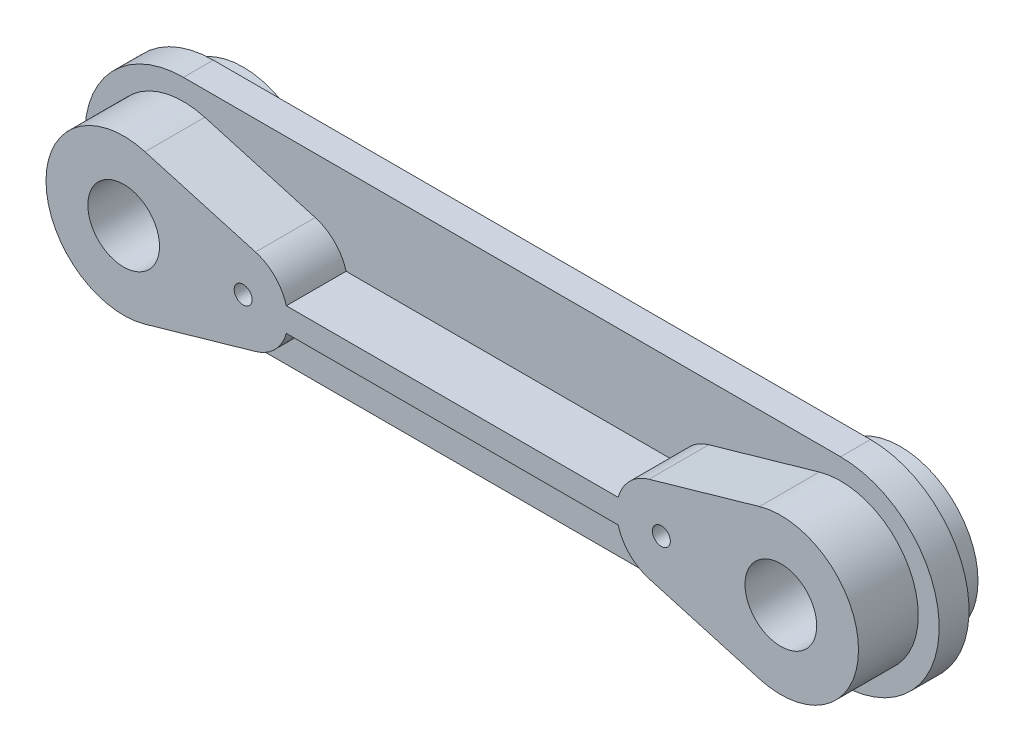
ISO-10303-21;
HEADER;
FILE_DESCRIPTION(('STEP AP214'),'2;1');
FILE_NAME('part.step','',(''),(''),'','','');
FILE_SCHEMA(('AUTOMOTIVE_DESIGN { 1 0 10303 214 1 1 1 1 }'));
ENDSEC;
DATA;
#1=APPLICATION_CONTEXT('core data for automotive mechanical design processes');
#2=APPLICATION_PROTOCOL_DEFINITION('international standard','automotive_design',2000,#1);
#3=PRODUCT_CONTEXT('',#1,'mechanical');
#4=PRODUCT('Part','Part','',(#3));
#5=PRODUCT_RELATED_PRODUCT_CATEGORY('part','',(#4));
#6=PRODUCT_DEFINITION_FORMATION('','',#4);
#7=PRODUCT_DEFINITION_CONTEXT('part definition',#1,'design');
#8=PRODUCT_DEFINITION('design','',#6,#7);
#9=PRODUCT_DEFINITION_SHAPE('','',#8);
#10=(LENGTH_UNIT() NAMED_UNIT(*) SI_UNIT(.MILLI.,.METRE.));
#11=(NAMED_UNIT(*) PLANE_ANGLE_UNIT() SI_UNIT($,.RADIAN.));
#12=(NAMED_UNIT(*) SI_UNIT($,.STERADIAN.) SOLID_ANGLE_UNIT());
#13=UNCERTAINTY_MEASURE_WITH_UNIT(LENGTH_MEASURE(1.E-05),#10,'distance_accuracy_value','');
#14=(GEOMETRIC_REPRESENTATION_CONTEXT(3) GLOBAL_UNCERTAINTY_ASSIGNED_CONTEXT((#13)) GLOBAL_UNIT_ASSIGNED_CONTEXT((#10,
#11,#12)) REPRESENTATION_CONTEXT('',''));
#15=CARTESIAN_POINT('',(0.,0.,0.));
#16=DIRECTION('',(0.,0.,1.));
#17=DIRECTION('',(1.,0.,0.));
#18=AXIS2_PLACEMENT_3D('',#15,#16,#17);
#19=CARTESIAN_POINT('',(0.,0.,0.));
#20=DIRECTION('',(0.,0.,1.));
#21=DIRECTION('',(1.,0.,0.));
#22=AXIS2_PLACEMENT_3D('',#19,#20,#21);
#23=PLANE('',#22);
#24=CARTESIAN_POINT('',(180.,0.,0.));
#25=DIRECTION('',(0.,0.,1.));
#26=DIRECTION('',(1.,0.,0.));
#27=AXIS2_PLACEMENT_3D('',#24,#25,#26);
#28=CIRCLE('',#27,2.99999999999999);
#29=CARTESIAN_POINT('',(183.,0.,0.));
#30=VERTEX_POINT('',#29);
#31=EDGE_CURVE('E507',#30,#30,#28,.T.);
#32=ORIENTED_EDGE('',*,*,#31,.T.);
#33=EDGE_LOOP('',(#32));
#34=FACE_BOUND('',#33,.T.);
#35=CARTESIAN_POINT('',(40.,0.,0.));
#36=DIRECTION('',(0.,0.,1.));
#37=DIRECTION('',(1.,0.,0.));
#38=AXIS2_PLACEMENT_3D('',#35,#36,#37);
#39=CIRCLE('',#38,3.);
#40=CARTESIAN_POINT('',(43.,0.,0.));
#41=VERTEX_POINT('',#40);
#42=EDGE_CURVE('E520',#41,#41,#39,.T.);
#43=ORIENTED_EDGE('',*,*,#42,.T.);
#44=EDGE_LOOP('',(#43));
#45=FACE_BOUND('',#44,.T.);
#46=CARTESIAN_POINT('',(220.,0.,0.));
#47=DIRECTION('',(0.,0.,1.));
#48=DIRECTION('',(1.,0.,0.));
#49=AXIS2_PLACEMENT_3D('',#46,#47,#48);
#50=CIRCLE('',#49,26.);
#51=CARTESIAN_POINT('',(246.,0.,0.));
#52=VERTEX_POINT('',#51);
#53=EDGE_CURVE('E47',#52,#52,#50,.F.);
#54=ORIENTED_EDGE('',*,*,#53,.F.);
#55=EDGE_LOOP('',(#54));
#56=FACE_BOUND('',#55,.T.);
#57=CARTESIAN_POINT('',(0.,0.,0.));
#58=DIRECTION('',(0.,0.,1.));
#59=DIRECTION('',(1.,0.,0.));
#60=AXIS2_PLACEMENT_3D('',#57,#58,#59);
#61=CIRCLE('',#60,33.);
#62=CARTESIAN_POINT('',(0.,33.,0.));
#63=VERTEX_POINT('',#62);
#64=CARTESIAN_POINT('',(0.,-33.,0.));
#65=VERTEX_POINT('',#64);
#66=EDGE_CURVE('E164',#63,#65,#61,.T.);
#67=ORIENTED_EDGE('',*,*,#66,.F.);
#68=DIRECTION('',(-1.,0.,0.));
#69=VECTOR('',#68,1.);
#70=CARTESIAN_POINT('',(0.,33.,0.));
#71=LINE('',#70,#69);
#72=CARTESIAN_POINT('',(220.,33.,0.));
#73=VERTEX_POINT('',#72);
#74=EDGE_CURVE('E259',#73,#63,#71,.T.);
#75=ORIENTED_EDGE('',*,*,#74,.F.);
#76=CARTESIAN_POINT('',(220.,0.,0.));
#77=DIRECTION('',(0.,0.,1.));
#78=DIRECTION('',(1.,0.,0.));
#79=AXIS2_PLACEMENT_3D('',#76,#77,#78);
#80=CIRCLE('',#79,33.);
#81=CARTESIAN_POINT('',(220.,-33.,0.));
#82=VERTEX_POINT('',#81);
#83=EDGE_CURVE('E257',#82,#73,#80,.T.);
#84=ORIENTED_EDGE('',*,*,#83,.F.);
#85=DIRECTION('',(1.,0.,0.));
#86=VECTOR('',#85,1.);
#87=CARTESIAN_POINT('',(0.,-33.,0.));
#88=LINE('',#87,#86);
#89=EDGE_CURVE('E255',#65,#82,#88,.T.);
#90=ORIENTED_EDGE('',*,*,#89,.F.);
#91=EDGE_LOOP('',(#67,#75,#84,#90));
#92=FACE_BOUND('',#91,.T.);
#93=CARTESIAN_POINT('',(0.,0.,0.));
#94=DIRECTION('',(0.,0.,1.));
#95=DIRECTION('',(1.,0.,0.));
#96=AXIS2_PLACEMENT_3D('',#93,#94,#95);
#97=CIRCLE('',#96,26.);
#98=CARTESIAN_POINT('',(26.,0.,0.));
#99=VERTEX_POINT('',#98);
#100=EDGE_CURVE('E11',#99,#99,#97,.F.);
#101=ORIENTED_EDGE('',*,*,#100,.F.);
#102=EDGE_LOOP('',(#101));
#103=FACE_BOUND('',#102,.T.);
#104=ADVANCED_FACE('F39',(#34,#45,#56,#92,#103),#23,.F.);
#105=CARTESIAN_POINT('',(0.,0.,10.));
#106=DIRECTION('',(0.,0.,1.));
#107=DIRECTION('',(1.,0.,0.));
#108=AXIS2_PLACEMENT_3D('',#105,#106,#107);
#109=PLANE('',#108);
#110=CARTESIAN_POINT('',(0.,0.,10.));
#111=DIRECTION('',(0.,0.,1.));
#112=DIRECTION('',(1.,0.,0.));
#113=AXIS2_PLACEMENT_3D('',#110,#111,#112);
#114=CIRCLE('',#113,33.);
#115=CARTESIAN_POINT('',(0.,33.,10.));
#116=VERTEX_POINT('',#115);
#117=CARTESIAN_POINT('',(0.,-33.,10.));
#118=VERTEX_POINT('',#117);
#119=EDGE_CURVE('E261',#116,#118,#114,.T.);
#120=ORIENTED_EDGE('',*,*,#119,.T.);
#121=DIRECTION('',(1.,0.,0.));
#122=VECTOR('',#121,1.);
#123=CARTESIAN_POINT('',(0.,-33.,10.));
#124=LINE('',#123,#122);
#125=CARTESIAN_POINT('',(220.,-33.,10.));
#126=VERTEX_POINT('',#125);
#127=EDGE_CURVE('E263',#118,#126,#124,.T.);
#128=ORIENTED_EDGE('',*,*,#127,.T.);
#129=CARTESIAN_POINT('',(220.,0.,10.));
#130=DIRECTION('',(0.,0.,1.));
#131=DIRECTION('',(1.,0.,0.));
#132=AXIS2_PLACEMENT_3D('',#129,#130,#131);
#133=CIRCLE('',#132,33.);
#134=CARTESIAN_POINT('',(220.,33.,10.));
#135=VERTEX_POINT('',#134);
#136=EDGE_CURVE('E265',#126,#135,#133,.T.);
#137=ORIENTED_EDGE('',*,*,#136,.T.);
#138=DIRECTION('',(-1.,0.,0.));
#139=VECTOR('',#138,1.);
#140=CARTESIAN_POINT('',(0.,33.,10.));
#141=LINE('',#140,#139);
#142=EDGE_CURVE('E62',#135,#116,#141,.T.);
#143=ORIENTED_EDGE('',*,*,#142,.T.);
#144=EDGE_LOOP('',(#120,#128,#137,#143));
#145=FACE_BOUND('',#144,.T.);
#146=DIRECTION('',(-0.961444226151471,0.275,0.));
#147=VECTOR('',#146,1.);
#148=CARTESIAN_POINT('',(44.125,14.4216633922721,10.));
#149=LINE('',#148,#147);
#150=CARTESIAN_POINT('',(44.125,14.4216633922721,10.));
#151=VERTEX_POINT('',#150);
#152=CARTESIAN_POINT('',(7.15,24.9975498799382,10.));
#153=VERTEX_POINT('',#152);
#154=EDGE_CURVE('E158',#151,#153,#149,.T.);
#155=ORIENTED_EDGE('',*,*,#154,.F.);
#156=CARTESIAN_POINT('',(40.,0.,10.));
#157=DIRECTION('',(0.,0.,1.));
#158=DIRECTION('',(1.,0.,0.));
#159=AXIS2_PLACEMENT_3D('',#156,#157,#158);
#160=CIRCLE('',#159,15.);
#161=CARTESIAN_POINT('',(54.456832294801,4.,10.));
#162=VERTEX_POINT('',#161);
#163=EDGE_CURVE('E169',#162,#151,#160,.T.);
#164=ORIENTED_EDGE('',*,*,#163,.F.);
#165=DIRECTION('',(-1.,0.,0.));
#166=VECTOR('',#165,1.);
#167=CARTESIAN_POINT('',(54.456832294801,4.,10.));
#168=LINE('',#167,#166);
#169=CARTESIAN_POINT('',(165.543167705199,4.,10.));
#170=VERTEX_POINT('',#169);
#171=EDGE_CURVE('E201',#170,#162,#168,.T.);
#172=ORIENTED_EDGE('',*,*,#171,.F.);
#173=CARTESIAN_POINT('',(180.,0.,10.));
#174=DIRECTION('',(0.,0.,1.));
#175=DIRECTION('',(1.,0.,0.));
#176=AXIS2_PLACEMENT_3D('',#173,#174,#175);
#177=CIRCLE('',#176,15.);
#178=CARTESIAN_POINT('',(175.875,14.4216633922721,10.));
#179=VERTEX_POINT('',#178);
#180=EDGE_CURVE('E199',#179,#170,#177,.T.);
#181=ORIENTED_EDGE('',*,*,#180,.F.);
#182=DIRECTION('',(-0.96144422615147,-0.275,0.));
#183=VECTOR('',#182,1.);
#184=CARTESIAN_POINT('',(175.875,14.4216633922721,10.));
#185=LINE('',#184,#183);
#186=CARTESIAN_POINT('',(212.85,24.9975498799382,10.));
#187=VERTEX_POINT('',#186);
#188=EDGE_CURVE('E197',#187,#179,#185,.T.);
#189=ORIENTED_EDGE('',*,*,#188,.F.);
#190=CARTESIAN_POINT('',(220.,0.,10.));
#191=DIRECTION('',(0.,0.,1.));
#192=DIRECTION('',(1.,0.,0.));
#193=AXIS2_PLACEMENT_3D('',#190,#191,#192);
#194=CIRCLE('',#193,26.);
#195=CARTESIAN_POINT('',(212.85,-24.9975498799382,10.));
#196=VERTEX_POINT('',#195);
#197=EDGE_CURVE('E195',#196,#187,#194,.T.);
#198=ORIENTED_EDGE('',*,*,#197,.F.);
#199=DIRECTION('',(0.961444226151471,-0.275,0.));
#200=VECTOR('',#199,1.);
#201=CARTESIAN_POINT('',(175.875,-14.4216633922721,10.));
#202=LINE('',#201,#200);
#203=CARTESIAN_POINT('',(175.875,-14.4216633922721,10.));
#204=VERTEX_POINT('',#203);
#205=EDGE_CURVE('E193',#204,#196,#202,.T.);
#206=ORIENTED_EDGE('',*,*,#205,.F.);
#207=CARTESIAN_POINT('',(180.,0.,10.));
#208=DIRECTION('',(0.,0.,1.));
#209=DIRECTION('',(1.,0.,0.));
#210=AXIS2_PLACEMENT_3D('',#207,#208,#209);
#211=CIRCLE('',#210,15.);
#212=CARTESIAN_POINT('',(165.543167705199,-4.,10.));
#213=VERTEX_POINT('',#212);
#214=EDGE_CURVE('E191',#213,#204,#211,.T.);
#215=ORIENTED_EDGE('',*,*,#214,.F.);
#216=DIRECTION('',(1.,0.,0.));
#217=VECTOR('',#216,1.);
#218=CARTESIAN_POINT('',(54.456832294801,-4.,10.));
#219=LINE('',#218,#217);
#220=CARTESIAN_POINT('',(54.456832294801,-4.,10.));
#221=VERTEX_POINT('',#220);
#222=EDGE_CURVE('E189',#221,#213,#219,.T.);
#223=ORIENTED_EDGE('',*,*,#222,.F.);
#224=CARTESIAN_POINT('',(40.,0.,10.));
#225=DIRECTION('',(0.,0.,1.));
#226=DIRECTION('',(1.,0.,0.));
#227=AXIS2_PLACEMENT_3D('',#224,#225,#226);
#228=CIRCLE('',#227,15.);
#229=CARTESIAN_POINT('',(44.125,-14.4216633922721,10.));
#230=VERTEX_POINT('',#229);
#231=EDGE_CURVE('E187',#230,#221,#228,.T.);
#232=ORIENTED_EDGE('',*,*,#231,.F.);
#233=DIRECTION('',(0.961444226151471,0.275,0.));
#234=VECTOR('',#233,1.);
#235=CARTESIAN_POINT('',(7.15,-24.9975498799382,10.));
#236=LINE('',#235,#234);
#237=CARTESIAN_POINT('',(7.15,-24.9975498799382,10.));
#238=VERTEX_POINT('',#237);
#239=EDGE_CURVE('E182',#238,#230,#236,.T.);
#240=ORIENTED_EDGE('',*,*,#239,.F.);
#241=CARTESIAN_POINT('',(0.,0.,10.));
#242=DIRECTION('',(0.,0.,1.));
#243=DIRECTION('',(1.,0.,0.));
#244=AXIS2_PLACEMENT_3D('',#241,#242,#243);
#245=CIRCLE('',#244,26.);
#246=EDGE_CURVE('E180',#153,#238,#245,.T.);
#247=ORIENTED_EDGE('',*,*,#246,.F.);
#248=EDGE_LOOP('',(#155,#164,#172,#181,#189,#198,#206,#215,#223,#232,#240,#247));
#249=FACE_BOUND('',#248,.T.);
#250=ADVANCED_FACE('F178',(#145,#249),#109,.T.);
#251=CARTESIAN_POINT('',(0.,0.,10.));
#252=DIRECTION('',(0.,0.,-1.));
#253=DIRECTION('',(-1.,0.,0.));
#254=AXIS2_PLACEMENT_3D('',#251,#252,#253);
#255=CYLINDRICAL_SURFACE('',#254,33.);
#256=ORIENTED_EDGE('',*,*,#66,.T.);
#257=DIRECTION('',(0.,0.,-1.));
#258=VECTOR('',#257,1.);
#259=CARTESIAN_POINT('',(0.,-33.,10.));
#260=LINE('',#259,#258);
#261=EDGE_CURVE('E277',#118,#65,#260,.T.);
#262=ORIENTED_EDGE('',*,*,#261,.F.);
#263=ORIENTED_EDGE('',*,*,#119,.F.);
#264=DIRECTION('',(0.,0.,-1.));
#265=VECTOR('',#264,1.);
#266=CARTESIAN_POINT('',(0.,33.,10.));
#267=LINE('',#266,#265);
#268=EDGE_CURVE('E268',#116,#63,#267,.T.);
#269=ORIENTED_EDGE('',*,*,#268,.T.);
#270=EDGE_LOOP('',(#256,#262,#263,#269));
#271=FACE_BOUND('',#270,.T.);
#272=ADVANCED_FACE('F41',(#271),#255,.T.);
#273=CARTESIAN_POINT('',(0.,-33.,10.));
#274=DIRECTION('',(0.,1.,0.));
#275=DIRECTION('',(-1.,0.,0.));
#276=AXIS2_PLACEMENT_3D('',#273,#274,#275);
#277=PLANE('',#276);
#278=ORIENTED_EDGE('',*,*,#89,.T.);
#279=DIRECTION('',(0.,0.,-1.));
#280=VECTOR('',#279,1.);
#281=CARTESIAN_POINT('',(220.,-33.,10.));
#282=LINE('',#281,#280);
#283=EDGE_CURVE('E274',#126,#82,#282,.T.);
#284=ORIENTED_EDGE('',*,*,#283,.F.);
#285=ORIENTED_EDGE('',*,*,#127,.F.);
#286=ORIENTED_EDGE('',*,*,#261,.T.);
#287=EDGE_LOOP('',(#278,#284,#285,#286));
#288=FACE_BOUND('',#287,.T.);
#289=ADVANCED_FACE('F369',(#288),#277,.F.);
#290=CARTESIAN_POINT('',(220.,0.,10.));
#291=DIRECTION('',(0.,0.,-1.));
#292=DIRECTION('',(-1.,0.,0.));
#293=AXIS2_PLACEMENT_3D('',#290,#291,#292);
#294=CYLINDRICAL_SURFACE('',#293,33.);
#295=ORIENTED_EDGE('',*,*,#83,.T.);
#296=DIRECTION('',(0.,0.,-1.));
#297=VECTOR('',#296,1.);
#298=CARTESIAN_POINT('',(220.,33.,10.));
#299=LINE('',#298,#297);
#300=EDGE_CURVE('E271',#135,#73,#299,.T.);
#301=ORIENTED_EDGE('',*,*,#300,.F.);
#302=ORIENTED_EDGE('',*,*,#136,.F.);
#303=ORIENTED_EDGE('',*,*,#283,.T.);
#304=EDGE_LOOP('',(#295,#301,#302,#303));
#305=FACE_BOUND('',#304,.T.);
#306=ADVANCED_FACE('F366',(#305),#294,.T.);
#307=CARTESIAN_POINT('',(0.,33.,10.));
#308=DIRECTION('',(0.,-1.,0.));
#309=DIRECTION('',(1.,0.,0.));
#310=AXIS2_PLACEMENT_3D('',#307,#308,#309);
#311=PLANE('',#310);
#312=ORIENTED_EDGE('',*,*,#74,.T.);
#313=ORIENTED_EDGE('',*,*,#268,.F.);
#314=ORIENTED_EDGE('',*,*,#142,.F.);
#315=ORIENTED_EDGE('',*,*,#300,.T.);
#316=EDGE_LOOP('',(#312,#313,#314,#315));
#317=FACE_BOUND('',#316,.T.);
#318=ADVANCED_FACE('F360',(#317),#311,.F.);
#319=CARTESIAN_POINT('',(40.,0.,30.));
#320=DIRECTION('',(0.,0.,-1.));
#321=DIRECTION('',(-1.,0.,0.));
#322=AXIS2_PLACEMENT_3D('',#319,#320,#321);
#323=CYLINDRICAL_SURFACE('',#322,15.);
#324=ORIENTED_EDGE('',*,*,#163,.T.);
#325=DIRECTION('',(0.,0.,-1.));
#326=VECTOR('',#325,1.);
#327=CARTESIAN_POINT('',(44.125,14.4216633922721,30.));
#328=LINE('',#327,#326);
#329=CARTESIAN_POINT('',(44.125,14.4216633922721,30.));
#330=VERTEX_POINT('',#329);
#331=EDGE_CURVE('E153',#330,#151,#328,.T.);
#332=ORIENTED_EDGE('',*,*,#331,.F.);
#333=CARTESIAN_POINT('',(40.,0.,30.));
#334=DIRECTION('',(0.,0.,1.));
#335=DIRECTION('',(1.,0.,0.));
#336=AXIS2_PLACEMENT_3D('',#333,#334,#335);
#337=CIRCLE('',#336,15.);
#338=CARTESIAN_POINT('',(54.456832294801,4.,30.));
#339=VERTEX_POINT('',#338);
#340=EDGE_CURVE('E203',#339,#330,#337,.T.);
#341=ORIENTED_EDGE('',*,*,#340,.F.);
#342=DIRECTION('',(0.,0.,-1.));
#343=VECTOR('',#342,1.);
#344=CARTESIAN_POINT('',(54.456832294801,4.,30.));
#345=LINE('',#344,#343);
#346=EDGE_CURVE('E172',#339,#162,#345,.T.);
#347=ORIENTED_EDGE('',*,*,#346,.T.);
#348=EDGE_LOOP('',(#324,#332,#341,#347));
#349=FACE_BOUND('',#348,.T.);
#350=ADVANCED_FACE('F170',(#349),#323,.T.);
#351=CARTESIAN_POINT('',(44.125,14.4216633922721,30.));
#352=DIRECTION('',(-0.275,-0.961444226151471,0.));
#353=DIRECTION('',(0.961444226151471,-0.275,0.));
#354=AXIS2_PLACEMENT_3D('',#351,#352,#353);
#355=PLANE('',#354);
#356=ORIENTED_EDGE('',*,*,#154,.T.);
#357=DIRECTION('',(0.,0.,-1.));
#358=VECTOR('',#357,1.);
#359=CARTESIAN_POINT('',(7.15,24.9975498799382,30.));
#360=LINE('',#359,#358);
#361=CARTESIAN_POINT('',(7.15,24.9975498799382,30.));
#362=VERTEX_POINT('',#361);
#363=EDGE_CURVE('E165',#362,#153,#360,.T.);
#364=ORIENTED_EDGE('',*,*,#363,.F.);
#365=DIRECTION('',(-0.961444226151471,0.275,0.));
#366=VECTOR('',#365,1.);
#367=CARTESIAN_POINT('',(44.125,14.4216633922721,30.));
#368=LINE('',#367,#366);
#369=EDGE_CURVE('E160',#330,#362,#368,.T.);
#370=ORIENTED_EDGE('',*,*,#369,.F.);
#371=ORIENTED_EDGE('',*,*,#331,.T.);
#372=EDGE_LOOP('',(#356,#364,#370,#371));
#373=FACE_BOUND('',#372,.T.);
#374=ADVANCED_FACE('F155',(#373),#355,.F.);
#375=CARTESIAN_POINT('',(0.,0.,30.));
#376=DIRECTION('',(0.,0.,-1.));
#377=DIRECTION('',(-1.,0.,0.));
#378=AXIS2_PLACEMENT_3D('',#375,#376,#377);
#379=CYLINDRICAL_SURFACE('',#378,26.);
#380=ORIENTED_EDGE('',*,*,#246,.T.);
#381=DIRECTION('',(0.,0.,-1.));
#382=VECTOR('',#381,1.);
#383=CARTESIAN_POINT('',(7.15,-24.9975498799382,30.));
#384=LINE('',#383,#382);
#385=CARTESIAN_POINT('',(7.15,-24.9975498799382,30.));
#386=VERTEX_POINT('',#385);
#387=EDGE_CURVE('E249',#386,#238,#384,.T.);
#388=ORIENTED_EDGE('',*,*,#387,.F.);
#389=CARTESIAN_POINT('',(0.,0.,30.));
#390=DIRECTION('',(0.,0.,1.));
#391=DIRECTION('',(1.,0.,0.));
#392=AXIS2_PLACEMENT_3D('',#389,#390,#391);
#393=CIRCLE('',#392,26.);
#394=EDGE_CURVE('E206',#362,#386,#393,.T.);
#395=ORIENTED_EDGE('',*,*,#394,.F.);
#396=ORIENTED_EDGE('',*,*,#363,.T.);
#397=EDGE_LOOP('',(#380,#388,#395,#396));
#398=FACE_BOUND('',#397,.T.);
#399=ADVANCED_FACE('F352',(#398),#379,.T.);
#400=CARTESIAN_POINT('',(7.15,-24.9975498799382,30.));
#401=DIRECTION('',(-0.275,0.961444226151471,0.));
#402=DIRECTION('',(-0.961444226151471,-0.275,0.));
#403=AXIS2_PLACEMENT_3D('',#400,#401,#402);
#404=PLANE('',#403);
#405=ORIENTED_EDGE('',*,*,#239,.T.);
#406=DIRECTION('',(0.,0.,-1.));
#407=VECTOR('',#406,1.);
#408=CARTESIAN_POINT('',(44.125,-14.4216633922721,30.));
#409=LINE('',#408,#407);
#410=CARTESIAN_POINT('',(44.125,-14.4216633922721,30.));
#411=VERTEX_POINT('',#410);
#412=EDGE_CURVE('E246',#411,#230,#409,.T.);
#413=ORIENTED_EDGE('',*,*,#412,.F.);
#414=DIRECTION('',(0.961444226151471,0.275,0.));
#415=VECTOR('',#414,1.);
#416=CARTESIAN_POINT('',(7.15,-24.9975498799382,30.));
#417=LINE('',#416,#415);
#418=EDGE_CURVE('E208',#386,#411,#417,.T.);
#419=ORIENTED_EDGE('',*,*,#418,.F.);
#420=ORIENTED_EDGE('',*,*,#387,.T.);
#421=EDGE_LOOP('',(#405,#413,#419,#420));
#422=FACE_BOUND('',#421,.T.);
#423=ADVANCED_FACE('F348',(#422),#404,.F.);
#424=CARTESIAN_POINT('',(40.,0.,30.));
#425=DIRECTION('',(0.,0.,-1.));
#426=DIRECTION('',(-1.,0.,0.));
#427=AXIS2_PLACEMENT_3D('',#424,#425,#426);
#428=CYLINDRICAL_SURFACE('',#427,15.);
#429=ORIENTED_EDGE('',*,*,#231,.T.);
#430=DIRECTION('',(0.,0.,-1.));
#431=VECTOR('',#430,1.);
#432=CARTESIAN_POINT('',(54.456832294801,-4.,30.));
#433=LINE('',#432,#431);
#434=CARTESIAN_POINT('',(54.456832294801,-4.,30.));
#435=VERTEX_POINT('',#434);
#436=EDGE_CURVE('E243',#435,#221,#433,.T.);
#437=ORIENTED_EDGE('',*,*,#436,.F.);
#438=CARTESIAN_POINT('',(40.,0.,30.));
#439=DIRECTION('',(0.,0.,1.));
#440=DIRECTION('',(1.,0.,0.));
#441=AXIS2_PLACEMENT_3D('',#438,#439,#440);
#442=CIRCLE('',#441,15.);
#443=EDGE_CURVE('E210',#411,#435,#442,.T.);
#444=ORIENTED_EDGE('',*,*,#443,.F.);
#445=ORIENTED_EDGE('',*,*,#412,.T.);
#446=EDGE_LOOP('',(#429,#437,#444,#445));
#447=FACE_BOUND('',#446,.T.);
#448=ADVANCED_FACE('F344',(#447),#428,.T.);
#449=CARTESIAN_POINT('',(54.456832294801,-4.,30.));
#450=DIRECTION('',(0.,1.,0.));
#451=DIRECTION('',(0.,0.,1.));
#452=AXIS2_PLACEMENT_3D('',#449,#450,#451);
#453=PLANE('',#452);
#454=ORIENTED_EDGE('',*,*,#222,.T.);
#455=DIRECTION('',(0.,0.,-1.));
#456=VECTOR('',#455,1.);
#457=CARTESIAN_POINT('',(165.543167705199,-4.,30.));
#458=LINE('',#457,#456);
#459=CARTESIAN_POINT('',(165.543167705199,-4.,30.));
#460=VERTEX_POINT('',#459);
#461=EDGE_CURVE('E240',#460,#213,#458,.T.);
#462=ORIENTED_EDGE('',*,*,#461,.F.);
#463=DIRECTION('',(1.,0.,0.));
#464=VECTOR('',#463,1.);
#465=CARTESIAN_POINT('',(54.456832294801,-4.,30.));
#466=LINE('',#465,#464);
#467=EDGE_CURVE('E212',#435,#460,#466,.T.);
#468=ORIENTED_EDGE('',*,*,#467,.F.);
#469=ORIENTED_EDGE('',*,*,#436,.T.);
#470=EDGE_LOOP('',(#454,#462,#468,#469));
#471=FACE_BOUND('',#470,.T.);
#472=ADVANCED_FACE('F340',(#471),#453,.F.);
#473=CARTESIAN_POINT('',(180.,0.,30.));
#474=DIRECTION('',(0.,0.,-1.));
#475=DIRECTION('',(-1.,0.,0.));
#476=AXIS2_PLACEMENT_3D('',#473,#474,#475);
#477=CYLINDRICAL_SURFACE('',#476,15.);
#478=ORIENTED_EDGE('',*,*,#214,.T.);
#479=DIRECTION('',(0.,0.,-1.));
#480=VECTOR('',#479,1.);
#481=CARTESIAN_POINT('',(175.875,-14.4216633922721,30.));
#482=LINE('',#481,#480);
#483=CARTESIAN_POINT('',(175.875,-14.4216633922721,30.));
#484=VERTEX_POINT('',#483);
#485=EDGE_CURVE('E237',#484,#204,#482,.T.);
#486=ORIENTED_EDGE('',*,*,#485,.F.);
#487=CARTESIAN_POINT('',(180.,0.,30.));
#488=DIRECTION('',(0.,0.,1.));
#489=DIRECTION('',(1.,0.,0.));
#490=AXIS2_PLACEMENT_3D('',#487,#488,#489);
#491=CIRCLE('',#490,15.);
#492=EDGE_CURVE('E214',#460,#484,#491,.T.);
#493=ORIENTED_EDGE('',*,*,#492,.F.);
#494=ORIENTED_EDGE('',*,*,#461,.T.);
#495=EDGE_LOOP('',(#478,#486,#493,#494));
#496=FACE_BOUND('',#495,.T.);
#497=ADVANCED_FACE('F336',(#496),#477,.T.);
#498=CARTESIAN_POINT('',(175.875,-14.4216633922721,30.));
#499=DIRECTION('',(0.275,0.961444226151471,0.));
#500=DIRECTION('',(-0.961444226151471,0.275,0.));
#501=AXIS2_PLACEMENT_3D('',#498,#499,#500);
#502=PLANE('',#501);
#503=ORIENTED_EDGE('',*,*,#205,.T.);
#504=DIRECTION('',(0.,0.,-1.));
#505=VECTOR('',#504,1.);
#506=CARTESIAN_POINT('',(212.85,-24.9975498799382,30.));
#507=LINE('',#506,#505);
#508=CARTESIAN_POINT('',(212.85,-24.9975498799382,30.));
#509=VERTEX_POINT('',#508);
#510=EDGE_CURVE('E234',#509,#196,#507,.T.);
#511=ORIENTED_EDGE('',*,*,#510,.F.);
#512=DIRECTION('',(0.961444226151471,-0.275,0.));
#513=VECTOR('',#512,1.);
#514=CARTESIAN_POINT('',(175.875,-14.4216633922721,30.));
#515=LINE('',#514,#513);
#516=EDGE_CURVE('E216',#484,#509,#515,.T.);
#517=ORIENTED_EDGE('',*,*,#516,.F.);
#518=ORIENTED_EDGE('',*,*,#485,.T.);
#519=EDGE_LOOP('',(#503,#511,#517,#518));
#520=FACE_BOUND('',#519,.T.);
#521=ADVANCED_FACE('F332',(#520),#502,.F.);
#522=CARTESIAN_POINT('',(220.,0.,30.));
#523=DIRECTION('',(0.,0.,-1.));
#524=DIRECTION('',(-1.,0.,0.));
#525=AXIS2_PLACEMENT_3D('',#522,#523,#524);
#526=CYLINDRICAL_SURFACE('',#525,26.);
#527=ORIENTED_EDGE('',*,*,#197,.T.);
#528=DIRECTION('',(0.,0.,-1.));
#529=VECTOR('',#528,1.);
#530=CARTESIAN_POINT('',(212.85,24.9975498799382,30.));
#531=LINE('',#530,#529);
#532=CARTESIAN_POINT('',(212.85,24.9975498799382,30.));
#533=VERTEX_POINT('',#532);
#534=EDGE_CURVE('E231',#533,#187,#531,.T.);
#535=ORIENTED_EDGE('',*,*,#534,.F.);
#536=CARTESIAN_POINT('',(220.,0.,30.));
#537=DIRECTION('',(0.,0.,1.));
#538=DIRECTION('',(1.,0.,0.));
#539=AXIS2_PLACEMENT_3D('',#536,#537,#538);
#540=CIRCLE('',#539,26.);
#541=EDGE_CURVE('E218',#509,#533,#540,.T.);
#542=ORIENTED_EDGE('',*,*,#541,.F.);
#543=ORIENTED_EDGE('',*,*,#510,.T.);
#544=EDGE_LOOP('',(#527,#535,#542,#543));
#545=FACE_BOUND('',#544,.T.);
#546=ADVANCED_FACE('F328',(#545),#526,.T.);
#547=CARTESIAN_POINT('',(175.875,14.4216633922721,30.));
#548=DIRECTION('',(0.275,-0.961444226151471,0.));
#549=DIRECTION('',(0.961444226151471,0.275,0.));
#550=AXIS2_PLACEMENT_3D('',#547,#548,#549);
#551=PLANE('',#550);
#552=ORIENTED_EDGE('',*,*,#188,.T.);
#553=DIRECTION('',(0.,0.,-1.));
#554=VECTOR('',#553,1.);
#555=CARTESIAN_POINT('',(175.875,14.4216633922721,30.));
#556=LINE('',#555,#554);
#557=CARTESIAN_POINT('',(175.875,14.4216633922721,30.));
#558=VERTEX_POINT('',#557);
#559=EDGE_CURVE('E228',#558,#179,#556,.T.);
#560=ORIENTED_EDGE('',*,*,#559,.F.);
#561=DIRECTION('',(-0.96144422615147,-0.275,0.));
#562=VECTOR('',#561,1.);
#563=CARTESIAN_POINT('',(175.875,14.4216633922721,30.));
#564=LINE('',#563,#562);
#565=EDGE_CURVE('E220',#533,#558,#564,.T.);
#566=ORIENTED_EDGE('',*,*,#565,.F.);
#567=ORIENTED_EDGE('',*,*,#534,.T.);
#568=EDGE_LOOP('',(#552,#560,#566,#567));
#569=FACE_BOUND('',#568,.T.);
#570=ADVANCED_FACE('F324',(#569),#551,.F.);
#571=CARTESIAN_POINT('',(180.,0.,30.));
#572=DIRECTION('',(0.,0.,-1.));
#573=DIRECTION('',(-1.,0.,0.));
#574=AXIS2_PLACEMENT_3D('',#571,#572,#573);
#575=CYLINDRICAL_SURFACE('',#574,15.);
#576=ORIENTED_EDGE('',*,*,#180,.T.);
#577=DIRECTION('',(0.,0.,-1.));
#578=VECTOR('',#577,1.);
#579=CARTESIAN_POINT('',(165.543167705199,4.,30.));
#580=LINE('',#579,#578);
#581=CARTESIAN_POINT('',(165.543167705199,4.,30.));
#582=VERTEX_POINT('',#581);
#583=EDGE_CURVE('E54',#582,#170,#580,.T.);
#584=ORIENTED_EDGE('',*,*,#583,.F.);
#585=CARTESIAN_POINT('',(180.,0.,30.));
#586=DIRECTION('',(0.,0.,1.));
#587=DIRECTION('',(1.,0.,0.));
#588=AXIS2_PLACEMENT_3D('',#585,#586,#587);
#589=CIRCLE('',#588,15.);
#590=EDGE_CURVE('E222',#558,#582,#589,.T.);
#591=ORIENTED_EDGE('',*,*,#590,.F.);
#592=ORIENTED_EDGE('',*,*,#559,.T.);
#593=EDGE_LOOP('',(#576,#584,#591,#592));
#594=FACE_BOUND('',#593,.T.);
#595=ADVANCED_FACE('F321',(#594),#575,.T.);
#596=CARTESIAN_POINT('',(54.456832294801,4.,30.));
#597=DIRECTION('',(0.,-1.,0.));
#598=DIRECTION('',(0.,0.,-1.));
#599=AXIS2_PLACEMENT_3D('',#596,#597,#598);
#600=PLANE('',#599);
#601=ORIENTED_EDGE('',*,*,#171,.T.);
#602=ORIENTED_EDGE('',*,*,#346,.F.);
#603=DIRECTION('',(-1.,0.,0.));
#604=VECTOR('',#603,1.);
#605=CARTESIAN_POINT('',(54.456832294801,4.,30.));
#606=LINE('',#605,#604);
#607=EDGE_CURVE('E224',#582,#339,#606,.T.);
#608=ORIENTED_EDGE('',*,*,#607,.F.);
#609=ORIENTED_EDGE('',*,*,#583,.T.);
#610=EDGE_LOOP('',(#601,#602,#608,#609));
#611=FACE_BOUND('',#610,.T.);
#612=ADVANCED_FACE('F317',(#611),#600,.F.);
#613=CARTESIAN_POINT('',(40.,0.,30.));
#614=DIRECTION('',(0.,0.,1.));
#615=DIRECTION('',(1.,0.,0.));
#616=AXIS2_PLACEMENT_3D('',#613,#614,#615);
#617=PLANE('',#616);
#618=CARTESIAN_POINT('',(180.,0.,30.));
#619=DIRECTION('',(0.,0.,1.));
#620=DIRECTION('',(1.,0.,0.));
#621=AXIS2_PLACEMENT_3D('',#618,#619,#620);
#622=CIRCLE('',#621,2.99999999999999);
#623=CARTESIAN_POINT('',(183.,0.,30.));
#624=VERTEX_POINT('',#623);
#625=EDGE_CURVE('E504',#624,#624,#622,.T.);
#626=ORIENTED_EDGE('',*,*,#625,.F.);
#627=EDGE_LOOP('',(#626));
#628=FACE_BOUND('',#627,.T.);
#629=CARTESIAN_POINT('',(220.,0.,30.));
#630=DIRECTION('',(0.,0.,1.));
#631=DIRECTION('',(1.,0.,0.));
#632=AXIS2_PLACEMENT_3D('',#629,#630,#631);
#633=CIRCLE('',#632,12.);
#634=CARTESIAN_POINT('',(232.,0.,30.));
#635=VERTEX_POINT('',#634);
#636=EDGE_CURVE('E508',#635,#635,#633,.T.);
#637=ORIENTED_EDGE('',*,*,#636,.F.);
#638=EDGE_LOOP('',(#637));
#639=FACE_BOUND('',#638,.T.);
#640=CARTESIAN_POINT('',(40.,0.,30.));
#641=DIRECTION('',(0.,0.,1.));
#642=DIRECTION('',(1.,0.,0.));
#643=AXIS2_PLACEMENT_3D('',#640,#641,#642);
#644=CIRCLE('',#643,3.);
#645=CARTESIAN_POINT('',(43.,0.,30.));
#646=VERTEX_POINT('',#645);
#647=EDGE_CURVE('E517',#646,#646,#644,.T.);
#648=ORIENTED_EDGE('',*,*,#647,.F.);
#649=EDGE_LOOP('',(#648));
#650=FACE_BOUND('',#649,.T.);
#651=CARTESIAN_POINT('',(0.,0.,30.));
#652=DIRECTION('',(0.,0.,1.));
#653=DIRECTION('',(1.,0.,0.));
#654=AXIS2_PLACEMENT_3D('',#651,#652,#653);
#655=CIRCLE('',#654,12.);
#656=CARTESIAN_POINT('',(12.,0.,30.));
#657=VERTEX_POINT('',#656);
#658=EDGE_CURVE('E523',#657,#657,#655,.T.);
#659=ORIENTED_EDGE('',*,*,#658,.F.);
#660=EDGE_LOOP('',(#659));
#661=FACE_BOUND('',#660,.T.);
#662=ORIENTED_EDGE('',*,*,#340,.T.);
#663=ORIENTED_EDGE('',*,*,#369,.T.);
#664=ORIENTED_EDGE('',*,*,#394,.T.);
#665=ORIENTED_EDGE('',*,*,#418,.T.);
#666=ORIENTED_EDGE('',*,*,#443,.T.);
#667=ORIENTED_EDGE('',*,*,#467,.T.);
#668=ORIENTED_EDGE('',*,*,#492,.T.);
#669=ORIENTED_EDGE('',*,*,#516,.T.);
#670=ORIENTED_EDGE('',*,*,#541,.T.);
#671=ORIENTED_EDGE('',*,*,#565,.T.);
#672=ORIENTED_EDGE('',*,*,#590,.T.);
#673=ORIENTED_EDGE('',*,*,#607,.T.);
#674=EDGE_LOOP('',(#662,#663,#664,#665,#666,#667,#668,#669,#670,#671,#672,#673));
#675=FACE_BOUND('',#674,.T.);
#676=ADVANCED_FACE('F313',(#628,#639,#650,#661,#675),#617,.T.);
#677=CARTESIAN_POINT('',(220.,0.,-10.));
#678=DIRECTION('',(0.,0.,1.));
#679=DIRECTION('',(1.,0.,0.));
#680=AXIS2_PLACEMENT_3D('',#677,#678,#679);
#681=CYLINDRICAL_SURFACE('',#680,26.);
#682=CARTESIAN_POINT('',(220.,0.,-10.));
#683=DIRECTION('',(0.,0.,-1.));
#684=DIRECTION('',(-1.,0.,0.));
#685=AXIS2_PLACEMENT_3D('',#682,#683,#684);
#686=CIRCLE('',#685,26.);
#687=CARTESIAN_POINT('',(194.,0.,-10.));
#688=VERTEX_POINT('',#687);
#689=EDGE_CURVE('E175',#688,#688,#686,.T.);
#690=ORIENTED_EDGE('',*,*,#689,.F.);
#691=EDGE_LOOP('',(#690));
#692=FACE_BOUND('',#691,.T.);
#693=ORIENTED_EDGE('',*,*,#53,.T.);
#694=EDGE_LOOP('',(#693));
#695=FACE_BOUND('',#694,.T.);
#696=ADVANCED_FACE('F282',(#692,#695),#681,.T.);
#697=CARTESIAN_POINT('',(220.,0.,-10.));
#698=DIRECTION('',(0.,0.,-1.));
#699=DIRECTION('',(-1.,0.,0.));
#700=AXIS2_PLACEMENT_3D('',#697,#698,#699);
#701=PLANE('',#700);
#702=CARTESIAN_POINT('',(220.,0.,-10.));
#703=DIRECTION('',(0.,0.,1.));
#704=DIRECTION('',(1.,0.,0.));
#705=AXIS2_PLACEMENT_3D('',#702,#703,#704);
#706=CIRCLE('',#705,12.);
#707=CARTESIAN_POINT('',(232.,0.,-10.));
#708=VERTEX_POINT('',#707);
#709=EDGE_CURVE('E511',#708,#708,#706,.T.);
#710=ORIENTED_EDGE('',*,*,#709,.T.);
#711=EDGE_LOOP('',(#710));
#712=FACE_BOUND('',#711,.T.);
#713=ORIENTED_EDGE('',*,*,#689,.T.);
#714=EDGE_LOOP('',(#713));
#715=FACE_BOUND('',#714,.T.);
#716=ADVANCED_FACE('F296',(#712,#715),#701,.T.);
#717=CARTESIAN_POINT('',(0.,0.,-10.));
#718=DIRECTION('',(0.,0.,1.));
#719=DIRECTION('',(1.,0.,0.));
#720=AXIS2_PLACEMENT_3D('',#717,#718,#719);
#721=CYLINDRICAL_SURFACE('',#720,26.);
#722=CARTESIAN_POINT('',(0.,0.,-10.));
#723=DIRECTION('',(0.,0.,-1.));
#724=DIRECTION('',(-1.,0.,0.));
#725=AXIS2_PLACEMENT_3D('',#722,#723,#724);
#726=CIRCLE('',#725,26.);
#727=CARTESIAN_POINT('',(-26.,0.,-10.));
#728=VERTEX_POINT('',#727);
#729=EDGE_CURVE('E529',#728,#728,#726,.T.);
#730=ORIENTED_EDGE('',*,*,#729,.F.);
#731=EDGE_LOOP('',(#730));
#732=FACE_BOUND('',#731,.T.);
#733=ORIENTED_EDGE('',*,*,#100,.T.);
#734=EDGE_LOOP('',(#733));
#735=FACE_BOUND('',#734,.T.);
#736=ADVANCED_FACE('F293',(#732,#735),#721,.T.);
#737=CARTESIAN_POINT('',(0.,0.,-10.));
#738=DIRECTION('',(0.,0.,-1.));
#739=DIRECTION('',(-1.,0.,0.));
#740=AXIS2_PLACEMENT_3D('',#737,#738,#739);
#741=PLANE('',#740);
#742=CARTESIAN_POINT('',(0.,0.,-10.));
#743=DIRECTION('',(0.,0.,1.));
#744=DIRECTION('',(1.,0.,0.));
#745=AXIS2_PLACEMENT_3D('',#742,#743,#744);
#746=CIRCLE('',#745,12.);
#747=CARTESIAN_POINT('',(12.,0.,-10.));
#748=VERTEX_POINT('',#747);
#749=EDGE_CURVE('E526',#748,#748,#746,.T.);
#750=ORIENTED_EDGE('',*,*,#749,.T.);
#751=EDGE_LOOP('',(#750));
#752=FACE_BOUND('',#751,.T.);
#753=ORIENTED_EDGE('',*,*,#729,.T.);
#754=EDGE_LOOP('',(#753));
#755=FACE_BOUND('',#754,.T.);
#756=ADVANCED_FACE('F295',(#752,#755),#741,.T.);
#757=CARTESIAN_POINT('',(0.,0.,-10.));
#758=DIRECTION('',(0.,0.,1.));
#759=DIRECTION('',(1.,0.,0.));
#760=AXIS2_PLACEMENT_3D('',#757,#758,#759);
#761=CYLINDRICAL_SURFACE('',#760,12.);
#762=ORIENTED_EDGE('',*,*,#749,.F.);
#763=EDGE_LOOP('',(#762));
#764=FACE_BOUND('',#763,.T.);
#765=ORIENTED_EDGE('',*,*,#658,.T.);
#766=EDGE_LOOP('',(#765));
#767=FACE_BOUND('',#766,.T.);
#768=ADVANCED_FACE('F303',(#764,#767),#761,.F.);
#769=CARTESIAN_POINT('',(40.,0.,-10.));
#770=DIRECTION('',(0.,0.,1.));
#771=DIRECTION('',(1.,0.,0.));
#772=AXIS2_PLACEMENT_3D('',#769,#770,#771);
#773=CYLINDRICAL_SURFACE('',#772,3.);
#774=ORIENTED_EDGE('',*,*,#647,.T.);
#775=EDGE_LOOP('',(#774));
#776=FACE_BOUND('',#775,.T.);
#777=ORIENTED_EDGE('',*,*,#42,.F.);
#778=EDGE_LOOP('',(#777));
#779=FACE_BOUND('',#778,.T.);
#780=ADVANCED_FACE('F476',(#776,#779),#773,.F.);
#781=CARTESIAN_POINT('',(220.,0.,-10.));
#782=DIRECTION('',(0.,0.,1.));
#783=DIRECTION('',(1.,0.,0.));
#784=AXIS2_PLACEMENT_3D('',#781,#782,#783);
#785=CYLINDRICAL_SURFACE('',#784,12.);
#786=ORIENTED_EDGE('',*,*,#709,.F.);
#787=EDGE_LOOP('',(#786));
#788=FACE_BOUND('',#787,.T.);
#789=ORIENTED_EDGE('',*,*,#636,.T.);
#790=EDGE_LOOP('',(#789));
#791=FACE_BOUND('',#790,.T.);
#792=ADVANCED_FACE('F483',(#788,#791),#785,.F.);
#793=CARTESIAN_POINT('',(180.,0.,-10.));
#794=DIRECTION('',(0.,0.,1.));
#795=DIRECTION('',(1.,0.,0.));
#796=AXIS2_PLACEMENT_3D('',#793,#794,#795);
#797=CYLINDRICAL_SURFACE('',#796,2.99999999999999);
#798=ORIENTED_EDGE('',*,*,#625,.T.);
#799=EDGE_LOOP('',(#798));
#800=FACE_BOUND('',#799,.T.);
#801=ORIENTED_EDGE('',*,*,#31,.F.);
#802=EDGE_LOOP('',(#801));
#803=FACE_BOUND('',#802,.T.);
#804=ADVANCED_FACE('F491',(#800,#803),#797,.F.);
#805=CLOSED_SHELL('',(#104,#250,#272,#289,#306,#318,#350,#374,#399,#423,#448,#472,#497,#521,
#546,#570,#595,#612,#676,#696,#716,#736,#756,#768,#780,#792,#804));
#806=MANIFOLD_SOLID_BREP('B2',#805);
#807=ADVANCED_BREP_SHAPE_REPRESENTATION('',(#18,#806),#14);
#808=SHAPE_DEFINITION_REPRESENTATION(#9,#807);
ENDSEC;
END-ISO-10303-21;
